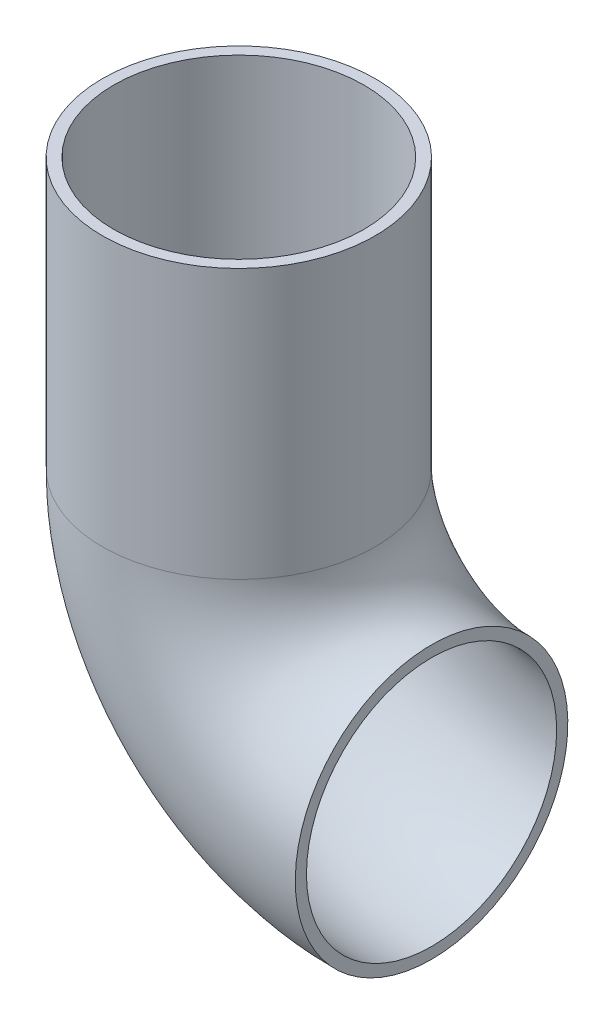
ISO-10303-21;
HEADER;
FILE_DESCRIPTION(('STEP AP214'),'2;1');
FILE_NAME('part.step','',(''),(''),'','','');
FILE_SCHEMA(('AUTOMOTIVE_DESIGN { 1 0 10303 214 1 1 1 1 }'));
ENDSEC;
DATA;
#1=APPLICATION_CONTEXT('core data for automotive mechanical design processes');
#2=APPLICATION_PROTOCOL_DEFINITION('international standard','automotive_design',2000,#1);
#3=PRODUCT_CONTEXT('',#1,'mechanical');
#4=PRODUCT('Part','Part','',(#3));
#5=PRODUCT_RELATED_PRODUCT_CATEGORY('part','',(#4));
#6=PRODUCT_DEFINITION_FORMATION('','',#4);
#7=PRODUCT_DEFINITION_CONTEXT('part definition',#1,'design');
#8=PRODUCT_DEFINITION('design','',#6,#7);
#9=PRODUCT_DEFINITION_SHAPE('','',#8);
#10=(LENGTH_UNIT() NAMED_UNIT(*) SI_UNIT(.MILLI.,.METRE.));
#11=(NAMED_UNIT(*) PLANE_ANGLE_UNIT() SI_UNIT($,.RADIAN.));
#12=(NAMED_UNIT(*) SI_UNIT($,.STERADIAN.) SOLID_ANGLE_UNIT());
#13=UNCERTAINTY_MEASURE_WITH_UNIT(LENGTH_MEASURE(1.E-05),#10,'distance_accuracy_value','');
#14=(GEOMETRIC_REPRESENTATION_CONTEXT(3) GLOBAL_UNCERTAINTY_ASSIGNED_CONTEXT((#13)) GLOBAL_UNIT_ASSIGNED_CONTEXT((#10,
#11,#12)) REPRESENTATION_CONTEXT('',''));
#15=CARTESIAN_POINT('',(0.,0.,0.));
#16=DIRECTION('',(0.,0.,1.));
#17=DIRECTION('',(1.,0.,0.));
#18=AXIS2_PLACEMENT_3D('',#15,#16,#17);
#19=CARTESIAN_POINT('',(31.75,0.,0.));
#20=DIRECTION('',(-1.,0.,0.));
#21=DIRECTION('',(0.,-1.,0.));
#22=AXIS2_PLACEMENT_3D('',#19,#20,#21);
#23=PLANE('',#22);
#24=CARTESIAN_POINT('',(31.75,0.,0.));
#25=DIRECTION('',(-1.,0.,0.));
#26=DIRECTION('',(0.,-1.,0.));
#27=AXIS2_PLACEMENT_3D('',#24,#25,#26);
#28=CIRCLE('',#27,20.60575);
#29=CARTESIAN_POINT('',(31.75,-20.60575,0.));
#30=VERTEX_POINT('',#29);
#31=EDGE_CURVE('E68',#30,#30,#28,.T.);
#32=ORIENTED_EDGE('',*,*,#31,.T.);
#33=EDGE_LOOP('',(#32));
#34=FACE_BOUND('',#33,.T.);
#35=CARTESIAN_POINT('',(31.75,0.,0.));
#36=DIRECTION('',(-1.,0.,0.));
#37=DIRECTION('',(0.,-1.,0.));
#38=AXIS2_PLACEMENT_3D('',#35,#36,#37);
#39=CIRCLE('',#38,22.44725);
#40=CARTESIAN_POINT('',(31.75,-22.44725,0.));
#41=VERTEX_POINT('',#40);
#42=EDGE_CURVE('E56',#41,#41,#39,.T.);
#43=ORIENTED_EDGE('',*,*,#42,.F.);
#44=EDGE_LOOP('',(#43));
#45=FACE_BOUND('',#44,.T.);
#46=ADVANCED_FACE('F45',(#34,#45),#23,.F.);
#47=CARTESIAN_POINT('',(0.,76.1178084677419,0.));
#48=DIRECTION('',(0.,1.,0.));
#49=DIRECTION('',(-1.,0.,0.));
#50=AXIS2_PLACEMENT_3D('',#47,#48,#49);
#51=PLANE('',#50);
#52=CARTESIAN_POINT('',(0.,76.1178084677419,0.));
#53=DIRECTION('',(0.,1.,0.));
#54=DIRECTION('',(-1.,0.,0.));
#55=AXIS2_PLACEMENT_3D('',#52,#53,#54);
#56=CIRCLE('',#55,20.60575);
#57=CARTESIAN_POINT('',(-20.60575,76.1178084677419,0.));
#58=VERTEX_POINT('',#57);
#59=EDGE_CURVE('E61',#58,#58,#56,.T.);
#60=ORIENTED_EDGE('',*,*,#59,.F.);
#61=EDGE_LOOP('',(#60));
#62=FACE_BOUND('',#61,.T.);
#63=CARTESIAN_POINT('',(0.,76.1178084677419,0.));
#64=DIRECTION('',(0.,1.,0.));
#65=DIRECTION('',(-1.,0.,0.));
#66=AXIS2_PLACEMENT_3D('',#63,#64,#65);
#67=CIRCLE('',#66,22.44725);
#68=CARTESIAN_POINT('',(-22.44725,76.1178084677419,0.));
#69=VERTEX_POINT('',#68);
#70=EDGE_CURVE('E11',#69,#69,#67,.T.);
#71=ORIENTED_EDGE('',*,*,#70,.T.);
#72=EDGE_LOOP('',(#71));
#73=FACE_BOUND('',#72,.T.);
#74=ADVANCED_FACE('F88',(#62,#73),#51,.T.);
#75=CARTESIAN_POINT('',(31.75,31.75,0.));
#76=DIRECTION('',(0.,0.,-1.));
#77=DIRECTION('',(-1.,0.,0.));
#78=AXIS2_PLACEMENT_3D('',#75,#76,#77);
#79=TOROIDAL_SURFACE('',#78,31.75,22.44725);
#80=CARTESIAN_POINT('',(0.,31.75,0.));
#81=DIRECTION('',(0.,1.,0.));
#82=DIRECTION('',(0.,0.,1.));
#83=AXIS2_PLACEMENT_3D('',#80,#81,#82);
#84=CIRCLE('',#83,22.44725);
#85=CARTESIAN_POINT('',(-22.44725,31.75,0.));
#86=VERTEX_POINT('',#85);
#87=EDGE_CURVE('E52',#86,#86,#84,.T.);
#88=CARTESIAN_POINT('',(31.75,31.75,0.));
#89=DIRECTION('',(0.,0.,-1.));
#90=DIRECTION('',(-1.,0.,0.));
#91=AXIS2_PLACEMENT_3D('',#88,#89,#90);
#92=CIRCLE('',#91,54.19725);
#93=EDGE_CURVE('',#41,#86,#92,.T.);
#94=ORIENTED_EDGE('',*,*,#42,.T.);
#95=ORIENTED_EDGE('',*,*,#87,.F.);
#96=ORIENTED_EDGE('',*,*,#93,.T.);
#97=ORIENTED_EDGE('',*,*,#93,.F.);
#98=EDGE_LOOP('',(#94,#96,#95,#97));
#99=FACE_BOUND('',#98,.T.);
#100=ADVANCED_FACE('F85',(#99),#79,.T.);
#101=CARTESIAN_POINT('',(0.,31.75,0.));
#102=DIRECTION('',(0.,1.,0.));
#103=DIRECTION('',(0.,0.,1.));
#104=AXIS2_PLACEMENT_3D('',#101,#102,#103);
#105=CYLINDRICAL_SURFACE('',#104,22.44725);
#106=ORIENTED_EDGE('',*,*,#70,.F.);
#107=EDGE_LOOP('',(#106));
#108=FACE_BOUND('',#107,.T.);
#109=ORIENTED_EDGE('',*,*,#87,.T.);
#110=EDGE_LOOP('',(#109));
#111=FACE_BOUND('',#110,.T.);
#112=ADVANCED_FACE('F47',(#108,#111),#105,.T.);
#113=CARTESIAN_POINT('',(31.75,31.75,0.));
#114=DIRECTION('',(0.,0.,-1.));
#115=DIRECTION('',(-1.,0.,0.));
#116=AXIS2_PLACEMENT_3D('',#113,#114,#115);
#117=TOROIDAL_SURFACE('',#116,31.75,20.60575);
#118=CARTESIAN_POINT('',(0.,31.75,0.));
#119=DIRECTION('',(0.,1.,0.));
#120=DIRECTION('',(-1.,0.,0.));
#121=AXIS2_PLACEMENT_3D('',#118,#119,#120);
#122=CIRCLE('',#121,20.60575);
#123=CARTESIAN_POINT('',(-20.60575,31.75,0.));
#124=VERTEX_POINT('',#123);
#125=EDGE_CURVE('E65',#124,#124,#122,.T.);
#126=CARTESIAN_POINT('',(31.75,31.75,0.));
#127=DIRECTION('',(0.,0.,-1.));
#128=DIRECTION('',(-1.,0.,0.));
#129=AXIS2_PLACEMENT_3D('',#126,#127,#128);
#130=CIRCLE('',#129,52.35575);
#131=EDGE_CURVE('',#30,#124,#130,.T.);
#132=ORIENTED_EDGE('',*,*,#31,.F.);
#133=ORIENTED_EDGE('',*,*,#125,.T.);
#134=ORIENTED_EDGE('',*,*,#131,.T.);
#135=ORIENTED_EDGE('',*,*,#131,.F.);
#136=EDGE_LOOP('',(#132,#134,#133,#135));
#137=FACE_BOUND('',#136,.T.);
#138=ADVANCED_FACE('F74',(#137),#117,.F.);
#139=CARTESIAN_POINT('',(0.,31.75,0.));
#140=DIRECTION('',(0.,1.,0.));
#141=DIRECTION('',(0.,0.,1.));
#142=AXIS2_PLACEMENT_3D('',#139,#140,#141);
#143=CYLINDRICAL_SURFACE('',#142,20.60575);
#144=ORIENTED_EDGE('',*,*,#59,.T.);
#145=EDGE_LOOP('',(#144));
#146=FACE_BOUND('',#145,.T.);
#147=ORIENTED_EDGE('',*,*,#125,.F.);
#148=EDGE_LOOP('',(#147));
#149=FACE_BOUND('',#148,.T.);
#150=ADVANCED_FACE('F76',(#146,#149),#143,.F.);
#151=CLOSED_SHELL('',(#46,#74,#100,#112,#138,#150));
#152=MANIFOLD_SOLID_BREP('B2',#151);
#153=ADVANCED_BREP_SHAPE_REPRESENTATION('',(#18,#152),#14);
#154=SHAPE_DEFINITION_REPRESENTATION(#9,#153);
ENDSEC;
END-ISO-10303-21;
